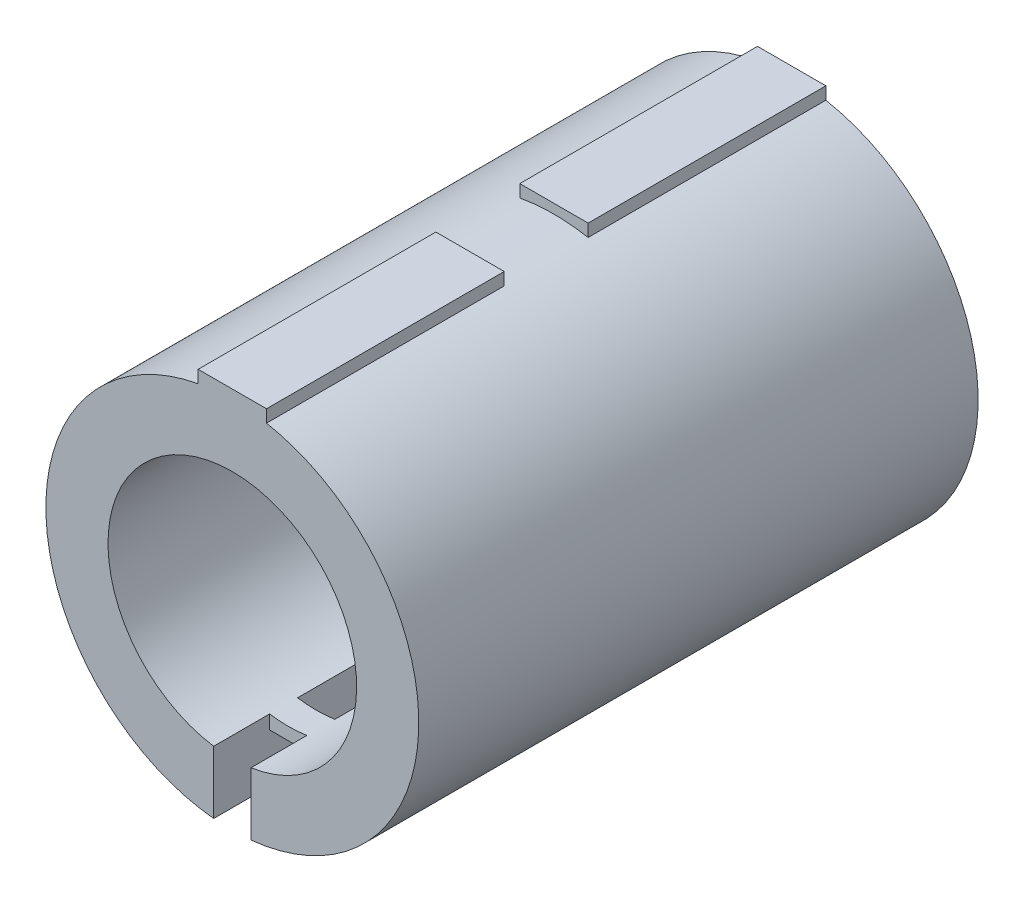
ISO-10303-21;
HEADER;
FILE_DESCRIPTION(('STEP AP214'),'2;1');
FILE_NAME('part.step','',(''),(''),'','','');
FILE_SCHEMA(('AUTOMOTIVE_DESIGN { 1 0 10303 214 1 1 1 1 }'));
ENDSEC;
DATA;
#1=APPLICATION_CONTEXT('core data for automotive mechanical design processes');
#2=APPLICATION_PROTOCOL_DEFINITION('international standard','automotive_design',2000,#1);
#3=PRODUCT_CONTEXT('',#1,'mechanical');
#4=PRODUCT('Part','Part','',(#3));
#5=PRODUCT_RELATED_PRODUCT_CATEGORY('part','',(#4));
#6=PRODUCT_DEFINITION_FORMATION('','',#4);
#7=PRODUCT_DEFINITION_CONTEXT('part definition',#1,'design');
#8=PRODUCT_DEFINITION('design','',#6,#7);
#9=PRODUCT_DEFINITION_SHAPE('','',#8);
#10=(LENGTH_UNIT() NAMED_UNIT(*) SI_UNIT(.MILLI.,.METRE.));
#11=(NAMED_UNIT(*) PLANE_ANGLE_UNIT() SI_UNIT($,.RADIAN.));
#12=(NAMED_UNIT(*) SI_UNIT($,.STERADIAN.) SOLID_ANGLE_UNIT());
#13=UNCERTAINTY_MEASURE_WITH_UNIT(LENGTH_MEASURE(1.E-05),#10,'distance_accuracy_value','');
#14=(GEOMETRIC_REPRESENTATION_CONTEXT(3) GLOBAL_UNCERTAINTY_ASSIGNED_CONTEXT((#13)) GLOBAL_UNIT_ASSIGNED_CONTEXT((#10,
#11,#12)) REPRESENTATION_CONTEXT('',''));
#15=CARTESIAN_POINT('',(0.,0.,0.));
#16=DIRECTION('',(0.,0.,1.));
#17=DIRECTION('',(1.,0.,0.));
#18=AXIS2_PLACEMENT_3D('',#15,#16,#17);
#19=CARTESIAN_POINT('',(3.29597460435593E-13,0.,22.5));
#20=DIRECTION('',(0.,0.,-1.));
#21=DIRECTION('',(0.,1.,0.));
#22=AXIS2_PLACEMENT_3D('',#19,#20,#21);
#23=CYLINDRICAL_SURFACE('',#22,14.9999999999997);
#24=CARTESIAN_POINT('',(3.29597460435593E-13,0.,3.375));
#25=DIRECTION('',(0.,0.,-1.));
#26=DIRECTION('',(-0.100000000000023,0.994987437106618,0.));
#27=AXIS2_PLACEMENT_3D('',#24,#25,#26);
#28=CIRCLE('',#27,14.9999999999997);
#29=CARTESIAN_POINT('',(2.75,14.7457621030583,3.375));
#30=VERTEX_POINT('',#29);
#31=CARTESIAN_POINT('',(-2.75,14.7457621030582,3.375));
#32=VERTEX_POINT('',#31);
#33=EDGE_CURVE('E32',#30,#32,#28,.F.);
#34=ORIENTED_EDGE('',*,*,#33,.F.);
#35=DIRECTION('',(0.,0.,-1.));
#36=VECTOR('',#35,1.);
#37=CARTESIAN_POINT('',(2.75,14.7457621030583,22.5));
#38=LINE('',#37,#36);
#39=CARTESIAN_POINT('',(2.75,14.7457621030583,22.5));
#40=VERTEX_POINT('',#39);
#41=EDGE_CURVE('E187',#40,#30,#38,.T.);
#42=ORIENTED_EDGE('',*,*,#41,.F.);
#43=CARTESIAN_POINT('',(3.29597460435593E-13,0.,22.5));
#44=DIRECTION('',(0.,0.,-1.));
#45=DIRECTION('',(0.0999999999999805,0.994987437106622,0.));
#46=AXIS2_PLACEMENT_3D('',#43,#44,#45);
#47=CIRCLE('',#46,14.9999999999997);
#48=CARTESIAN_POINT('',(1.5,-14.924811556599,22.5));
#49=VERTEX_POINT('',#48);
#50=EDGE_CURVE('E171',#49,#40,#47,.F.);
#51=ORIENTED_EDGE('',*,*,#50,.F.);
#52=DIRECTION('',(0.,0.,1.));
#53=VECTOR('',#52,1.);
#54=CARTESIAN_POINT('',(1.5,-14.924811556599,-22.5));
#55=LINE('',#54,#53);
#56=CARTESIAN_POINT('',(1.5,-14.924811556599,-22.5));
#57=VERTEX_POINT('',#56);
#58=EDGE_CURVE('E304',#49,#57,#55,.F.);
#59=ORIENTED_EDGE('',*,*,#58,.T.);
#60=CARTESIAN_POINT('',(3.29597460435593E-13,0.,-22.5));
#61=DIRECTION('',(0.,0.,1.));
#62=DIRECTION('',(0.09999999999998,-0.994987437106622,0.));
#63=AXIS2_PLACEMENT_3D('',#60,#61,#62);
#64=CIRCLE('',#63,14.9999999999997);
#65=CARTESIAN_POINT('',(2.75,14.7457621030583,-22.5));
#66=VERTEX_POINT('',#65);
#67=EDGE_CURVE('E336',#57,#66,#64,.T.);
#68=ORIENTED_EDGE('',*,*,#67,.T.);
#69=DIRECTION('',(0.,0.,-1.));
#70=VECTOR('',#69,1.);
#71=CARTESIAN_POINT('',(2.75,14.7457621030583,22.5));
#72=LINE('',#71,#70);
#73=CARTESIAN_POINT('',(2.75,14.7457621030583,-3.375));
#74=VERTEX_POINT('',#73);
#75=EDGE_CURVE('E210',#74,#66,#72,.T.);
#76=ORIENTED_EDGE('',*,*,#75,.F.);
#77=CARTESIAN_POINT('',(3.29597460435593E-13,0.,-3.375));
#78=DIRECTION('',(0.,0.,1.));
#79=DIRECTION('',(0.0999999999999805,0.994987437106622,0.));
#80=AXIS2_PLACEMENT_3D('',#77,#78,#79);
#81=CIRCLE('',#80,14.9999999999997);
#82=CARTESIAN_POINT('',(-2.75,14.7457621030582,-3.375));
#83=VERTEX_POINT('',#82);
#84=EDGE_CURVE('E340',#74,#83,#81,.T.);
#85=ORIENTED_EDGE('',*,*,#84,.T.);
#86=DIRECTION('',(0.,0.,-1.));
#87=VECTOR('',#86,1.);
#88=CARTESIAN_POINT('',(-2.75,14.7457621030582,22.5));
#89=LINE('',#88,#87);
#90=CARTESIAN_POINT('',(-2.75,14.7457621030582,-22.5));
#91=VERTEX_POINT('',#90);
#92=EDGE_CURVE('E200',#83,#91,#89,.T.);
#93=ORIENTED_EDGE('',*,*,#92,.T.);
#94=CARTESIAN_POINT('',(3.29597460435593E-13,0.,-22.5));
#95=DIRECTION('',(0.,0.,1.));
#96=DIRECTION('',(-0.100000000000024,0.994987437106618,0.));
#97=AXIS2_PLACEMENT_3D('',#94,#95,#96);
#98=CIRCLE('',#97,14.9999999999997);
#99=CARTESIAN_POINT('',(-1.5,-14.9248115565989,-22.5));
#100=VERTEX_POINT('',#99);
#101=EDGE_CURVE('E344',#91,#100,#98,.T.);
#102=ORIENTED_EDGE('',*,*,#101,.T.);
#103=DIRECTION('',(0.,0.,-1.));
#104=VECTOR('',#103,1.);
#105=CARTESIAN_POINT('',(-1.5,-14.924811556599,22.5));
#106=LINE('',#105,#104);
#107=CARTESIAN_POINT('',(-1.5,-14.924811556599,22.5));
#108=VERTEX_POINT('',#107);
#109=EDGE_CURVE('E255',#108,#100,#106,.T.);
#110=ORIENTED_EDGE('',*,*,#109,.F.);
#111=CARTESIAN_POINT('',(3.29597460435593E-13,0.,22.5));
#112=DIRECTION('',(0.,0.,-1.));
#113=DIRECTION('',(-0.100000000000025,-0.994987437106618,0.));
#114=AXIS2_PLACEMENT_3D('',#111,#112,#113);
#115=CIRCLE('',#114,14.9999999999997);
#116=CARTESIAN_POINT('',(-2.75,14.7457621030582,22.5));
#117=VERTEX_POINT('',#116);
#118=EDGE_CURVE('E18',#117,#108,#115,.F.);
#119=ORIENTED_EDGE('',*,*,#118,.F.);
#120=DIRECTION('',(0.,0.,-1.));
#121=VECTOR('',#120,1.);
#122=CARTESIAN_POINT('',(-2.75,14.7457621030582,22.5));
#123=LINE('',#122,#121);
#124=EDGE_CURVE('E183',#117,#32,#123,.T.);
#125=ORIENTED_EDGE('',*,*,#124,.T.);
#126=EDGE_LOOP('',(#34,#42,#51,#59,#68,#76,#85,#93,#102,#110,#119,#125));
#127=FACE_BOUND('',#126,.T.);
#128=ADVANCED_FACE('F14',(#127),#23,.T.);
#129=CARTESIAN_POINT('',(-1.5,15.75,-3.375));
#130=DIRECTION('',(0.,1.,0.));
#131=DIRECTION('',(1.,0.,0.));
#132=AXIS2_PLACEMENT_3D('',#129,#130,#131);
#133=PLANE('',#132);
#134=DIRECTION('',(1.,0.,0.));
#135=VECTOR('',#134,1.);
#136=CARTESIAN_POINT('',(-1.5,15.75,-3.375));
#137=LINE('',#136,#135);
#138=CARTESIAN_POINT('',(2.75,15.75,-3.375));
#139=VERTEX_POINT('',#138);
#140=CARTESIAN_POINT('',(-2.75,15.75,-3.375));
#141=VERTEX_POINT('',#140);
#142=EDGE_CURVE('E213',#139,#141,#137,.F.);
#143=ORIENTED_EDGE('',*,*,#142,.F.);
#144=DIRECTION('',(0.,0.,1.));
#145=VECTOR('',#144,1.);
#146=CARTESIAN_POINT('',(2.75,15.75,-3.375));
#147=LINE('',#146,#145);
#148=CARTESIAN_POINT('',(2.75,15.75,-22.5));
#149=VERTEX_POINT('',#148);
#150=EDGE_CURVE('E190',#149,#139,#147,.T.);
#151=ORIENTED_EDGE('',*,*,#150,.F.);
#152=DIRECTION('',(-1.,0.,0.));
#153=VECTOR('',#152,1.);
#154=CARTESIAN_POINT('',(1.5,15.75,-22.5));
#155=LINE('',#154,#153);
#156=CARTESIAN_POINT('',(-2.75,15.75,-22.5));
#157=VERTEX_POINT('',#156);
#158=EDGE_CURVE('E215',#149,#157,#155,.T.);
#159=ORIENTED_EDGE('',*,*,#158,.T.);
#160=DIRECTION('',(0.,0.,1.));
#161=VECTOR('',#160,1.);
#162=CARTESIAN_POINT('',(-2.75,15.75,-3.375));
#163=LINE('',#162,#161);
#164=EDGE_CURVE('E189',#157,#141,#163,.T.);
#165=ORIENTED_EDGE('',*,*,#164,.T.);
#166=EDGE_LOOP('',(#143,#151,#159,#165));
#167=FACE_BOUND('',#166,.T.);
#168=ADVANCED_FACE('F460',(#167),#133,.T.);
#169=CARTESIAN_POINT('',(-1.5,-14.924811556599,-22.5));
#170=DIRECTION('',(1.,0.,0.));
#171=DIRECTION('',(0.,1.,0.));
#172=AXIS2_PLACEMENT_3D('',#169,#170,#171);
#173=PLANE('',#172);
#174=DIRECTION('',(0.,0.,1.));
#175=VECTOR('',#174,1.);
#176=CARTESIAN_POINT('',(-1.5,-11.,-18.));
#177=LINE('',#176,#175);
#178=CARTESIAN_POINT('',(-1.5,-11.,-15.75));
#179=VERTEX_POINT('',#178);
#180=CARTESIAN_POINT('',(-1.5,-11.,-18.));
#181=VERTEX_POINT('',#180);
#182=EDGE_CURVE('E219',#179,#181,#177,.F.);
#183=ORIENTED_EDGE('',*,*,#182,.F.);
#184=DIRECTION('',(0.,1.,0.));
#185=VECTOR('',#184,1.);
#186=CARTESIAN_POINT('',(-1.5,-11.,-15.75));
#187=LINE('',#186,#185);
#188=CARTESIAN_POINT('',(-1.5,-9.8868599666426,-15.75));
#189=VERTEX_POINT('',#188);
#190=EDGE_CURVE('E224',#189,#179,#187,.F.);
#191=ORIENTED_EDGE('',*,*,#190,.F.);
#192=DIRECTION('',(0.,0.,1.));
#193=VECTOR('',#192,1.);
#194=CARTESIAN_POINT('',(-1.5,-9.8868599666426,-15.75));
#195=LINE('',#194,#193);
#196=CARTESIAN_POINT('',(-1.5,-9.8868599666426,15.75));
#197=VERTEX_POINT('',#196);
#198=EDGE_CURVE('E228',#197,#189,#195,.F.);
#199=ORIENTED_EDGE('',*,*,#198,.F.);
#200=DIRECTION('',(0.,-1.,0.));
#201=VECTOR('',#200,1.);
#202=CARTESIAN_POINT('',(-1.5,-9.8868599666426,15.75));
#203=LINE('',#202,#201);
#204=CARTESIAN_POINT('',(-1.5,-11.,15.75));
#205=VERTEX_POINT('',#204);
#206=EDGE_CURVE('E232',#197,#205,#203,.T.);
#207=ORIENTED_EDGE('',*,*,#206,.T.);
#208=DIRECTION('',(0.,0.,1.));
#209=VECTOR('',#208,1.);
#210=CARTESIAN_POINT('',(-1.5,-11.,15.75));
#211=LINE('',#210,#209);
#212=CARTESIAN_POINT('',(-1.5,-11.,18.));
#213=VERTEX_POINT('',#212);
#214=EDGE_CURVE('E237',#205,#213,#211,.T.);
#215=ORIENTED_EDGE('',*,*,#214,.T.);
#216=DIRECTION('',(0.,1.,0.));
#217=VECTOR('',#216,1.);
#218=CARTESIAN_POINT('',(-1.5,-11.,18.));
#219=LINE('',#218,#217);
#220=CARTESIAN_POINT('',(-1.5,-9.8868599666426,18.));
#221=VERTEX_POINT('',#220);
#222=EDGE_CURVE('E242',#221,#213,#219,.F.);
#223=ORIENTED_EDGE('',*,*,#222,.F.);
#224=DIRECTION('',(0.,0.,1.));
#225=VECTOR('',#224,1.);
#226=CARTESIAN_POINT('',(-1.5,-9.8868599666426,18.));
#227=LINE('',#226,#225);
#228=CARTESIAN_POINT('',(-1.5,-9.8868599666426,22.5));
#229=VERTEX_POINT('',#228);
#230=EDGE_CURVE('E246',#229,#221,#227,.F.);
#231=ORIENTED_EDGE('',*,*,#230,.F.);
#232=DIRECTION('',(0.,-1.,0.));
#233=VECTOR('',#232,1.);
#234=CARTESIAN_POINT('',(-1.5,-9.8868599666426,22.5));
#235=LINE('',#234,#233);
#236=EDGE_CURVE('E250',#108,#229,#235,.F.);
#237=ORIENTED_EDGE('',*,*,#236,.F.);
#238=ORIENTED_EDGE('',*,*,#109,.T.);
#239=DIRECTION('',(0.,1.,0.));
#240=VECTOR('',#239,1.);
#241=CARTESIAN_POINT('',(-1.5,-14.9248115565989,-22.5));
#242=LINE('',#241,#240);
#243=CARTESIAN_POINT('',(-1.5,-9.8868599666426,-22.5));
#244=VERTEX_POINT('',#243);
#245=EDGE_CURVE('E260',#100,#244,#242,.T.);
#246=ORIENTED_EDGE('',*,*,#245,.T.);
#247=DIRECTION('',(0.,0.,1.));
#248=VECTOR('',#247,1.);
#249=CARTESIAN_POINT('',(-1.5,-9.8868599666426,-22.5));
#250=LINE('',#249,#248);
#251=CARTESIAN_POINT('',(-1.5,-9.8868599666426,-18.));
#252=VERTEX_POINT('',#251);
#253=EDGE_CURVE('E265',#252,#244,#250,.F.);
#254=ORIENTED_EDGE('',*,*,#253,.F.);
#255=DIRECTION('',(0.,-1.,0.));
#256=VECTOR('',#255,1.);
#257=CARTESIAN_POINT('',(-1.5,-9.8868599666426,-18.));
#258=LINE('',#257,#256);
#259=EDGE_CURVE('E269',#252,#181,#258,.T.);
#260=ORIENTED_EDGE('',*,*,#259,.T.);
#261=EDGE_LOOP('',(#183,#191,#199,#207,#215,#223,#231,#237,#238,#246,#254,#260));
#262=FACE_BOUND('',#261,.T.);
#263=ADVANCED_FACE('F404',(#262),#173,.T.);
#264=CARTESIAN_POINT('',(1.5,-14.924811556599,22.5));
#265=DIRECTION('',(-1.,0.,0.));
#266=DIRECTION('',(0.,1.,0.));
#267=AXIS2_PLACEMENT_3D('',#264,#265,#266);
#268=PLANE('',#267);
#269=DIRECTION('',(0.,0.,-1.));
#270=VECTOR('',#269,1.);
#271=CARTESIAN_POINT('',(1.5,-9.8868599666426,15.75));
#272=LINE('',#271,#270);
#273=CARTESIAN_POINT('',(1.5,-9.8868599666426,15.75));
#274=VERTEX_POINT('',#273);
#275=CARTESIAN_POINT('',(1.5,-9.8868599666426,-15.75));
#276=VERTEX_POINT('',#275);
#277=EDGE_CURVE('E274',#274,#276,#272,.T.);
#278=ORIENTED_EDGE('',*,*,#277,.T.);
#279=DIRECTION('',(0.,-1.,0.));
#280=VECTOR('',#279,1.);
#281=CARTESIAN_POINT('',(1.5,-9.8868599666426,-15.75));
#282=LINE('',#281,#280);
#283=CARTESIAN_POINT('',(1.5,-11.,-15.75));
#284=VERTEX_POINT('',#283);
#285=EDGE_CURVE('E279',#284,#276,#282,.F.);
#286=ORIENTED_EDGE('',*,*,#285,.F.);
#287=DIRECTION('',(0.,0.,-1.));
#288=VECTOR('',#287,1.);
#289=CARTESIAN_POINT('',(1.5,-11.,-15.75));
#290=LINE('',#289,#288);
#291=CARTESIAN_POINT('',(1.5,-11.,-18.));
#292=VERTEX_POINT('',#291);
#293=EDGE_CURVE('E284',#284,#292,#290,.T.);
#294=ORIENTED_EDGE('',*,*,#293,.T.);
#295=DIRECTION('',(0.,1.,0.));
#296=VECTOR('',#295,1.);
#297=CARTESIAN_POINT('',(1.5,-11.,-18.));
#298=LINE('',#297,#296);
#299=CARTESIAN_POINT('',(1.5,-9.8868599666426,-18.));
#300=VERTEX_POINT('',#299);
#301=EDGE_CURVE('E289',#292,#300,#298,.T.);
#302=ORIENTED_EDGE('',*,*,#301,.T.);
#303=DIRECTION('',(0.,0.,-1.));
#304=VECTOR('',#303,1.);
#305=CARTESIAN_POINT('',(1.5,-9.8868599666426,-18.));
#306=LINE('',#305,#304);
#307=CARTESIAN_POINT('',(1.5,-9.8868599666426,-22.5));
#308=VERTEX_POINT('',#307);
#309=EDGE_CURVE('E294',#300,#308,#306,.T.);
#310=ORIENTED_EDGE('',*,*,#309,.T.);
#311=DIRECTION('',(0.,-1.,0.));
#312=VECTOR('',#311,1.);
#313=CARTESIAN_POINT('',(1.5,-9.8868599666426,-22.5));
#314=LINE('',#313,#312);
#315=EDGE_CURVE('E299',#308,#57,#314,.T.);
#316=ORIENTED_EDGE('',*,*,#315,.T.);
#317=ORIENTED_EDGE('',*,*,#58,.F.);
#318=DIRECTION('',(0.,1.,0.));
#319=VECTOR('',#318,1.);
#320=CARTESIAN_POINT('',(1.5,-14.924811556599,22.5));
#321=LINE('',#320,#319);
#322=CARTESIAN_POINT('',(1.5,-9.8868599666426,22.5));
#323=VERTEX_POINT('',#322);
#324=EDGE_CURVE('E309',#323,#49,#321,.F.);
#325=ORIENTED_EDGE('',*,*,#324,.F.);
#326=DIRECTION('',(0.,0.,-1.));
#327=VECTOR('',#326,1.);
#328=CARTESIAN_POINT('',(1.5,-9.8868599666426,22.5));
#329=LINE('',#328,#327);
#330=CARTESIAN_POINT('',(1.5,-9.8868599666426,18.));
#331=VERTEX_POINT('',#330);
#332=EDGE_CURVE('E313',#323,#331,#329,.T.);
#333=ORIENTED_EDGE('',*,*,#332,.T.);
#334=DIRECTION('',(0.,-1.,0.));
#335=VECTOR('',#334,1.);
#336=CARTESIAN_POINT('',(1.5,-9.8868599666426,18.));
#337=LINE('',#336,#335);
#338=CARTESIAN_POINT('',(1.5,-11.,18.));
#339=VERTEX_POINT('',#338);
#340=EDGE_CURVE('E318',#339,#331,#337,.F.);
#341=ORIENTED_EDGE('',*,*,#340,.F.);
#342=DIRECTION('',(0.,0.,-1.));
#343=VECTOR('',#342,1.);
#344=CARTESIAN_POINT('',(1.5,-11.,18.));
#345=LINE('',#344,#343);
#346=CARTESIAN_POINT('',(1.5,-11.,15.75));
#347=VERTEX_POINT('',#346);
#348=EDGE_CURVE('E323',#347,#339,#345,.F.);
#349=ORIENTED_EDGE('',*,*,#348,.F.);
#350=DIRECTION('',(0.,1.,0.));
#351=VECTOR('',#350,1.);
#352=CARTESIAN_POINT('',(1.5,-11.,15.75));
#353=LINE('',#352,#351);
#354=EDGE_CURVE('E328',#347,#274,#353,.T.);
#355=ORIENTED_EDGE('',*,*,#354,.T.);
#356=EDGE_LOOP('',(#278,#286,#294,#302,#310,#316,#317,#325,#333,#341,#349,#355));
#357=FACE_BOUND('',#356,.T.);
#358=ADVANCED_FACE('F423',(#357),#268,.T.);
#359=CARTESIAN_POINT('',(-1.5,15.75,22.5));
#360=DIRECTION('',(0.,1.,0.));
#361=DIRECTION('',(1.,0.,0.));
#362=AXIS2_PLACEMENT_3D('',#359,#360,#361);
#363=PLANE('',#362);
#364=DIRECTION('',(1.,0.,0.));
#365=VECTOR('',#364,1.);
#366=CARTESIAN_POINT('',(-1.5,15.75,22.5));
#367=LINE('',#366,#365);
#368=CARTESIAN_POINT('',(2.75,15.75,22.5));
#369=VERTEX_POINT('',#368);
#370=CARTESIAN_POINT('',(-2.75,15.75,22.5));
#371=VERTEX_POINT('',#370);
#372=EDGE_CURVE('E153',#369,#371,#367,.F.);
#373=ORIENTED_EDGE('',*,*,#372,.F.);
#374=DIRECTION('',(0.,0.,1.));
#375=VECTOR('',#374,1.);
#376=CARTESIAN_POINT('',(2.75,15.75,22.5));
#377=LINE('',#376,#375);
#378=CARTESIAN_POINT('',(2.75,15.75,3.375));
#379=VERTEX_POINT('',#378);
#380=EDGE_CURVE('E157',#379,#369,#377,.T.);
#381=ORIENTED_EDGE('',*,*,#380,.F.);
#382=DIRECTION('',(-1.,0.,0.));
#383=VECTOR('',#382,1.);
#384=CARTESIAN_POINT('',(1.5,15.75,3.375));
#385=LINE('',#384,#383);
#386=CARTESIAN_POINT('',(-2.75,15.75,3.375));
#387=VERTEX_POINT('',#386);
#388=EDGE_CURVE('E164',#379,#387,#385,.T.);
#389=ORIENTED_EDGE('',*,*,#388,.T.);
#390=DIRECTION('',(0.,0.,1.));
#391=VECTOR('',#390,1.);
#392=CARTESIAN_POINT('',(-2.75,15.75,22.5));
#393=LINE('',#392,#391);
#394=EDGE_CURVE('E159',#387,#371,#393,.T.);
#395=ORIENTED_EDGE('',*,*,#394,.T.);
#396=EDGE_LOOP('',(#373,#381,#389,#395));
#397=FACE_BOUND('',#396,.T.);
#398=ADVANCED_FACE('F155',(#397),#363,.T.);
#399=CARTESIAN_POINT('',(-15.3290676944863,-14.924811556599,22.5));
#400=DIRECTION('',(0.,0.,1.));
#401=DIRECTION('',(1.,0.,0.));
#402=AXIS2_PLACEMENT_3D('',#399,#400,#401);
#403=PLANE('',#402);
#404=DIRECTION('',(0.,-1.,0.));
#405=VECTOR('',#404,1.);
#406=CARTESIAN_POINT('',(-2.75,14.099623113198,22.5));
#407=LINE('',#406,#405);
#408=EDGE_CURVE('E179',#371,#117,#407,.T.);
#409=ORIENTED_EDGE('',*,*,#408,.T.);
#410=ORIENTED_EDGE('',*,*,#118,.T.);
#411=ORIENTED_EDGE('',*,*,#236,.T.);
#412=CARTESIAN_POINT('',(0.,0.,22.5));
#413=DIRECTION('',(0.,0.,-1.));
#414=DIRECTION('',(1.,0.,0.));
#415=AXIS2_PLACEMENT_3D('',#412,#413,#414);
#416=CIRCLE('',#415,10.);
#417=EDGE_CURVE('E163',#323,#229,#416,.F.);
#418=ORIENTED_EDGE('',*,*,#417,.F.);
#419=ORIENTED_EDGE('',*,*,#324,.T.);
#420=ORIENTED_EDGE('',*,*,#50,.T.);
#421=DIRECTION('',(0.,-1.,0.));
#422=VECTOR('',#421,1.);
#423=CARTESIAN_POINT('',(2.75,14.099623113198,22.5));
#424=LINE('',#423,#422);
#425=EDGE_CURVE('E168',#369,#40,#424,.T.);
#426=ORIENTED_EDGE('',*,*,#425,.F.);
#427=ORIENTED_EDGE('',*,*,#372,.T.);
#428=EDGE_LOOP('',(#409,#410,#411,#418,#419,#420,#426,#427));
#429=FACE_BOUND('',#428,.T.);
#430=ADVANCED_FACE('F169',(#429),#403,.T.);
#431=CARTESIAN_POINT('',(-15.3290676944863,-14.924811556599,-22.5));
#432=DIRECTION('',(0.,0.,-1.));
#433=DIRECTION('',(0.,1.,0.));
#434=AXIS2_PLACEMENT_3D('',#431,#432,#433);
#435=PLANE('',#434);
#436=ORIENTED_EDGE('',*,*,#158,.F.);
#437=DIRECTION('',(0.,1.,0.));
#438=VECTOR('',#437,1.);
#439=CARTESIAN_POINT('',(2.75,14.099623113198,-22.5));
#440=LINE('',#439,#438);
#441=EDGE_CURVE('E197',#66,#149,#440,.T.);
#442=ORIENTED_EDGE('',*,*,#441,.F.);
#443=ORIENTED_EDGE('',*,*,#67,.F.);
#444=ORIENTED_EDGE('',*,*,#315,.F.);
#445=CARTESIAN_POINT('',(0.,0.,-22.5));
#446=DIRECTION('',(0.,0.,1.));
#447=DIRECTION('',(-1.,-1.71650659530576E-08,0.));
#448=AXIS2_PLACEMENT_3D('',#445,#446,#447);
#449=CIRCLE('',#448,10.);
#450=EDGE_CURVE('E383',#308,#244,#449,.T.);
#451=ORIENTED_EDGE('',*,*,#450,.T.);
#452=ORIENTED_EDGE('',*,*,#245,.F.);
#453=ORIENTED_EDGE('',*,*,#101,.F.);
#454=DIRECTION('',(0.,1.,0.));
#455=VECTOR('',#454,1.);
#456=CARTESIAN_POINT('',(-2.75,14.099623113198,-22.5));
#457=LINE('',#456,#455);
#458=EDGE_CURVE('E194',#91,#157,#457,.T.);
#459=ORIENTED_EDGE('',*,*,#458,.T.);
#460=EDGE_LOOP('',(#436,#442,#443,#444,#451,#452,#453,#459));
#461=FACE_BOUND('',#460,.T.);
#462=ADVANCED_FACE('F410',(#461),#435,.T.);
#463=CARTESIAN_POINT('',(-1.5,-11.,18.));
#464=DIRECTION('',(0.,-1.,0.));
#465=DIRECTION('',(0.,0.,-1.));
#466=AXIS2_PLACEMENT_3D('',#463,#464,#465);
#467=PLANE('',#466);
#468=DIRECTION('',(-1.,0.,0.));
#469=VECTOR('',#468,1.);
#470=CARTESIAN_POINT('',(1.5,-11.,18.));
#471=LINE('',#470,#469);
#472=EDGE_CURVE('E379',#213,#339,#471,.F.);
#473=ORIENTED_EDGE('',*,*,#472,.F.);
#474=ORIENTED_EDGE('',*,*,#214,.F.);
#475=DIRECTION('',(1.,0.,0.));
#476=VECTOR('',#475,1.);
#477=CARTESIAN_POINT('',(-1.5,-11.,15.75));
#478=LINE('',#477,#476);
#479=EDGE_CURVE('E374',#205,#347,#478,.T.);
#480=ORIENTED_EDGE('',*,*,#479,.T.);
#481=ORIENTED_EDGE('',*,*,#348,.T.);
#482=EDGE_LOOP('',(#473,#474,#480,#481));
#483=FACE_BOUND('',#482,.T.);
#484=ADVANCED_FACE('F437',(#483),#467,.T.);
#485=CARTESIAN_POINT('',(-1.5,-11.,15.75));
#486=DIRECTION('',(0.,0.,-1.));
#487=DIRECTION('',(0.,1.,0.));
#488=AXIS2_PLACEMENT_3D('',#485,#486,#487);
#489=PLANE('',#488);
#490=CARTESIAN_POINT('',(0.,0.,15.75));
#491=DIRECTION('',(0.,0.,1.));
#492=DIRECTION('',(-0.15,-0.988685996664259,0.));
#493=AXIS2_PLACEMENT_3D('',#490,#491,#492);
#494=CIRCLE('',#493,10.);
#495=EDGE_CURVE('E369',#197,#274,#494,.T.);
#496=ORIENTED_EDGE('',*,*,#495,.T.);
#497=ORIENTED_EDGE('',*,*,#354,.F.);
#498=ORIENTED_EDGE('',*,*,#479,.F.);
#499=ORIENTED_EDGE('',*,*,#206,.F.);
#500=EDGE_LOOP('',(#496,#497,#498,#499));
#501=FACE_BOUND('',#500,.T.);
#502=ADVANCED_FACE('F433',(#501),#489,.T.);
#503=CARTESIAN_POINT('',(-1.5,-11.,18.));
#504=DIRECTION('',(0.,0.,1.));
#505=DIRECTION('',(1.,0.,0.));
#506=AXIS2_PLACEMENT_3D('',#503,#504,#505);
#507=PLANE('',#506);
#508=CARTESIAN_POINT('',(0.,0.,18.));
#509=DIRECTION('',(0.,0.,-1.));
#510=DIRECTION('',(0.15,-0.988685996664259,0.));
#511=AXIS2_PLACEMENT_3D('',#508,#509,#510);
#512=CIRCLE('',#511,10.);
#513=EDGE_CURVE('E365',#221,#331,#512,.F.);
#514=ORIENTED_EDGE('',*,*,#513,.F.);
#515=ORIENTED_EDGE('',*,*,#222,.T.);
#516=ORIENTED_EDGE('',*,*,#472,.T.);
#517=ORIENTED_EDGE('',*,*,#340,.T.);
#518=EDGE_LOOP('',(#514,#515,#516,#517));
#519=FACE_BOUND('',#518,.T.);
#520=ADVANCED_FACE('F442',(#519),#507,.T.);
#521=CARTESIAN_POINT('',(-1.5,-11.,-18.));
#522=DIRECTION('',(0.,-1.,0.));
#523=DIRECTION('',(1.,0.,0.));
#524=AXIS2_PLACEMENT_3D('',#521,#522,#523);
#525=PLANE('',#524);
#526=DIRECTION('',(1.,0.,0.));
#527=VECTOR('',#526,1.);
#528=CARTESIAN_POINT('',(-1.5,-11.,-18.));
#529=LINE('',#528,#527);
#530=EDGE_CURVE('E360',#181,#292,#529,.T.);
#531=ORIENTED_EDGE('',*,*,#530,.T.);
#532=ORIENTED_EDGE('',*,*,#293,.F.);
#533=DIRECTION('',(-1.,0.,0.));
#534=VECTOR('',#533,1.);
#535=CARTESIAN_POINT('',(1.5,-11.,-15.75));
#536=LINE('',#535,#534);
#537=EDGE_CURVE('E356',#179,#284,#536,.F.);
#538=ORIENTED_EDGE('',*,*,#537,.F.);
#539=ORIENTED_EDGE('',*,*,#182,.T.);
#540=EDGE_LOOP('',(#531,#532,#538,#539));
#541=FACE_BOUND('',#540,.T.);
#542=ADVANCED_FACE('F419',(#541),#525,.T.);
#543=CARTESIAN_POINT('',(-1.5,-11.,-15.75));
#544=DIRECTION('',(0.,0.,1.));
#545=DIRECTION('',(1.,0.,0.));
#546=AXIS2_PLACEMENT_3D('',#543,#544,#545);
#547=PLANE('',#546);
#548=CARTESIAN_POINT('',(0.,0.,-15.75));
#549=DIRECTION('',(0.,0.,-1.));
#550=DIRECTION('',(0.15,-0.988685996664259,0.));
#551=AXIS2_PLACEMENT_3D('',#548,#549,#550);
#552=CIRCLE('',#551,10.);
#553=EDGE_CURVE('E24',#189,#276,#552,.F.);
#554=ORIENTED_EDGE('',*,*,#553,.F.);
#555=ORIENTED_EDGE('',*,*,#190,.T.);
#556=ORIENTED_EDGE('',*,*,#537,.T.);
#557=ORIENTED_EDGE('',*,*,#285,.T.);
#558=EDGE_LOOP('',(#554,#555,#556,#557));
#559=FACE_BOUND('',#558,.T.);
#560=ADVANCED_FACE('F426',(#559),#547,.T.);
#561=CARTESIAN_POINT('',(-1.5,-11.,-18.));
#562=DIRECTION('',(0.,0.,-1.));
#563=DIRECTION('',(0.,1.,0.));
#564=AXIS2_PLACEMENT_3D('',#561,#562,#563);
#565=PLANE('',#564);
#566=CARTESIAN_POINT('',(0.,0.,-18.));
#567=DIRECTION('',(0.,0.,1.));
#568=DIRECTION('',(-0.15,-0.988685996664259,0.));
#569=AXIS2_PLACEMENT_3D('',#566,#567,#568);
#570=CIRCLE('',#569,10.);
#571=EDGE_CURVE('E9',#252,#300,#570,.T.);
#572=ORIENTED_EDGE('',*,*,#571,.T.);
#573=ORIENTED_EDGE('',*,*,#301,.F.);
#574=ORIENTED_EDGE('',*,*,#530,.F.);
#575=ORIENTED_EDGE('',*,*,#259,.F.);
#576=EDGE_LOOP('',(#572,#573,#574,#575));
#577=FACE_BOUND('',#576,.T.);
#578=ADVANCED_FACE('F416',(#577),#565,.T.);
#579=CARTESIAN_POINT('',(-1.5,14.924811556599,3.375));
#580=DIRECTION('',(0.,0.,-1.));
#581=DIRECTION('',(0.,1.,0.));
#582=AXIS2_PLACEMENT_3D('',#579,#580,#581);
#583=PLANE('',#582);
#584=ORIENTED_EDGE('',*,*,#388,.F.);
#585=DIRECTION('',(0.,1.,0.));
#586=VECTOR('',#585,1.);
#587=CARTESIAN_POINT('',(2.75,14.099623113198,3.375));
#588=LINE('',#587,#586);
#589=EDGE_CURVE('E173',#30,#379,#588,.T.);
#590=ORIENTED_EDGE('',*,*,#589,.F.);
#591=ORIENTED_EDGE('',*,*,#33,.T.);
#592=DIRECTION('',(0.,1.,0.));
#593=VECTOR('',#592,1.);
#594=CARTESIAN_POINT('',(-2.75,14.099623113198,3.375));
#595=LINE('',#594,#593);
#596=EDGE_CURVE('E177',#32,#387,#595,.T.);
#597=ORIENTED_EDGE('',*,*,#596,.T.);
#598=EDGE_LOOP('',(#584,#590,#591,#597));
#599=FACE_BOUND('',#598,.T.);
#600=ADVANCED_FACE('F446',(#599),#583,.T.);
#601=CARTESIAN_POINT('',(-1.5,14.924811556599,-3.375));
#602=DIRECTION('',(0.,0.,1.));
#603=DIRECTION('',(1.,0.,0.));
#604=AXIS2_PLACEMENT_3D('',#601,#602,#603);
#605=PLANE('',#604);
#606=ORIENTED_EDGE('',*,*,#142,.T.);
#607=DIRECTION('',(0.,-1.,0.));
#608=VECTOR('',#607,1.);
#609=CARTESIAN_POINT('',(-2.75,14.099623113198,-3.375));
#610=LINE('',#609,#608);
#611=EDGE_CURVE('E203',#141,#83,#610,.T.);
#612=ORIENTED_EDGE('',*,*,#611,.T.);
#613=ORIENTED_EDGE('',*,*,#84,.F.);
#614=DIRECTION('',(0.,-1.,0.));
#615=VECTOR('',#614,1.);
#616=CARTESIAN_POINT('',(2.75,14.099623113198,-3.375));
#617=LINE('',#616,#615);
#618=EDGE_CURVE('E193',#139,#74,#617,.T.);
#619=ORIENTED_EDGE('',*,*,#618,.F.);
#620=EDGE_LOOP('',(#606,#612,#613,#619));
#621=FACE_BOUND('',#620,.T.);
#622=ADVANCED_FACE('F489',(#621),#605,.T.);
#623=CARTESIAN_POINT('',(0.,0.,22.5));
#624=DIRECTION('',(0.,0.,-1.));
#625=DIRECTION('',(1.,0.,0.));
#626=AXIS2_PLACEMENT_3D('',#623,#624,#625);
#627=CYLINDRICAL_SURFACE('',#626,10.);
#628=ORIENTED_EDGE('',*,*,#309,.F.);
#629=ORIENTED_EDGE('',*,*,#571,.F.);
#630=ORIENTED_EDGE('',*,*,#253,.T.);
#631=ORIENTED_EDGE('',*,*,#450,.F.);
#632=EDGE_LOOP('',(#628,#629,#630,#631));
#633=FACE_BOUND('',#632,.T.);
#634=ORIENTED_EDGE('',*,*,#553,.T.);
#635=ORIENTED_EDGE('',*,*,#277,.F.);
#636=ORIENTED_EDGE('',*,*,#495,.F.);
#637=ORIENTED_EDGE('',*,*,#198,.T.);
#638=EDGE_LOOP('',(#634,#635,#636,#637));
#639=FACE_BOUND('',#638,.T.);
#640=ORIENTED_EDGE('',*,*,#230,.T.);
#641=ORIENTED_EDGE('',*,*,#513,.T.);
#642=ORIENTED_EDGE('',*,*,#332,.F.);
#643=ORIENTED_EDGE('',*,*,#417,.T.);
#644=EDGE_LOOP('',(#640,#641,#642,#643));
#645=FACE_BOUND('',#644,.T.);
#646=ADVANCED_FACE('F16',(#633,#639,#645),#627,.F.);
#647=CARTESIAN_POINT('',(-2.75,0.,0.));
#648=DIRECTION('',(1.,0.,0.));
#649=DIRECTION('',(0.,0.,-1.));
#650=AXIS2_PLACEMENT_3D('',#647,#648,#649);
#651=PLANE('',#650);
#652=ORIENTED_EDGE('',*,*,#92,.F.);
#653=ORIENTED_EDGE('',*,*,#611,.F.);
#654=ORIENTED_EDGE('',*,*,#164,.F.);
#655=ORIENTED_EDGE('',*,*,#458,.F.);
#656=EDGE_LOOP('',(#652,#653,#654,#655));
#657=FACE_BOUND('',#656,.T.);
#658=ADVANCED_FACE('F495',(#657),#651,.F.);
#659=CARTESIAN_POINT('',(2.75,0.,0.));
#660=DIRECTION('',(1.,0.,0.));
#661=DIRECTION('',(0.,0.,-1.));
#662=AXIS2_PLACEMENT_3D('',#659,#660,#661);
#663=PLANE('',#662);
#664=ORIENTED_EDGE('',*,*,#618,.T.);
#665=ORIENTED_EDGE('',*,*,#75,.T.);
#666=ORIENTED_EDGE('',*,*,#441,.T.);
#667=ORIENTED_EDGE('',*,*,#150,.T.);
#668=EDGE_LOOP('',(#664,#665,#666,#667));
#669=FACE_BOUND('',#668,.T.);
#670=ADVANCED_FACE('F456',(#669),#663,.T.);
#671=CARTESIAN_POINT('',(2.75,0.,0.));
#672=DIRECTION('',(1.,0.,0.));
#673=DIRECTION('',(0.,0.,-1.));
#674=AXIS2_PLACEMENT_3D('',#671,#672,#673);
#675=PLANE('',#674);
#676=ORIENTED_EDGE('',*,*,#425,.T.);
#677=ORIENTED_EDGE('',*,*,#41,.T.);
#678=ORIENTED_EDGE('',*,*,#589,.T.);
#679=ORIENTED_EDGE('',*,*,#380,.T.);
#680=EDGE_LOOP('',(#676,#677,#678,#679));
#681=FACE_BOUND('',#680,.T.);
#682=ADVANCED_FACE('F176',(#681),#675,.T.);
#683=CARTESIAN_POINT('',(-2.75,0.,0.));
#684=DIRECTION('',(1.,0.,0.));
#685=DIRECTION('',(0.,0.,-1.));
#686=AXIS2_PLACEMENT_3D('',#683,#684,#685);
#687=PLANE('',#686);
#688=ORIENTED_EDGE('',*,*,#124,.F.);
#689=ORIENTED_EDGE('',*,*,#408,.F.);
#690=ORIENTED_EDGE('',*,*,#394,.F.);
#691=ORIENTED_EDGE('',*,*,#596,.F.);
#692=EDGE_LOOP('',(#688,#689,#690,#691));
#693=FACE_BOUND('',#692,.T.);
#694=ADVANCED_FACE('F449',(#693),#687,.F.);
#695=CLOSED_SHELL('',(#128,#168,#263,#358,#398,#430,#462,#484,#502,#520,#542,#560,#578,#600,
#622,#646,#658,#670,#682,#694));
#696=MANIFOLD_SOLID_BREP('B1',#695);
#697=ADVANCED_BREP_SHAPE_REPRESENTATION('',(#18,#696),#14);
#698=SHAPE_DEFINITION_REPRESENTATION(#9,#697);
ENDSEC;
END-ISO-10303-21;
